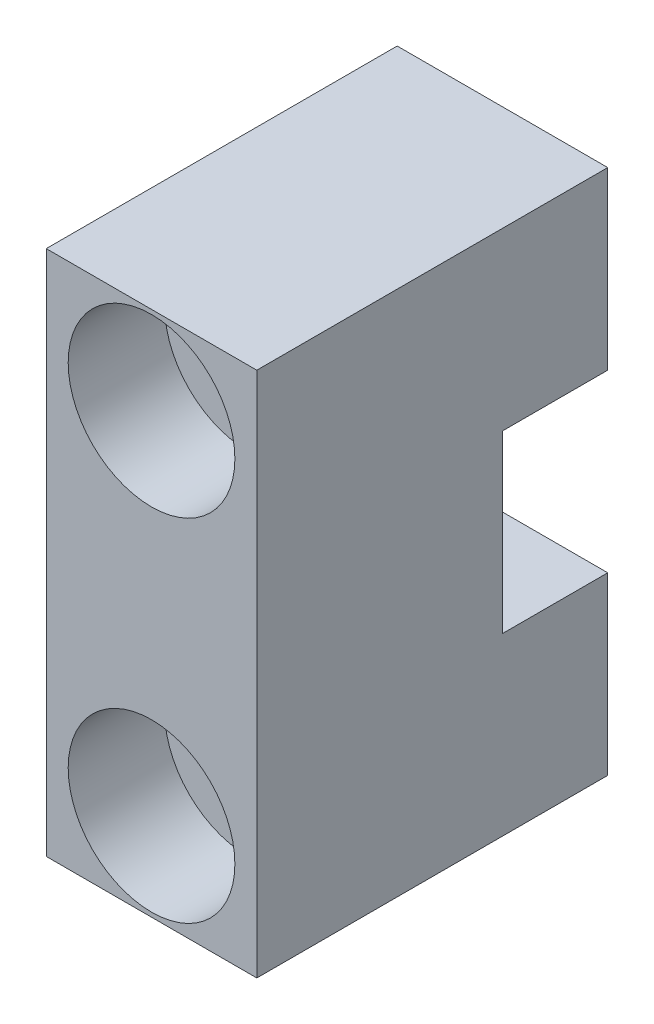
ISO-10303-21;
HEADER;
FILE_DESCRIPTION(('STEP AP214'),'2;1');
FILE_NAME('part.step','',(''),(''),'','','');
FILE_SCHEMA(('AUTOMOTIVE_DESIGN { 1 0 10303 214 1 1 1 1 }'));
ENDSEC;
DATA;
#1=APPLICATION_CONTEXT('core data for automotive mechanical design processes');
#2=APPLICATION_PROTOCOL_DEFINITION('international standard','automotive_design',2000,#1);
#3=PRODUCT_CONTEXT('',#1,'mechanical');
#4=PRODUCT('Part','Part','',(#3));
#5=PRODUCT_RELATED_PRODUCT_CATEGORY('part','',(#4));
#6=PRODUCT_DEFINITION_FORMATION('','',#4);
#7=PRODUCT_DEFINITION_CONTEXT('part definition',#1,'design');
#8=PRODUCT_DEFINITION('design','',#6,#7);
#9=PRODUCT_DEFINITION_SHAPE('','',#8);
#10=(LENGTH_UNIT() NAMED_UNIT(*) SI_UNIT(.MILLI.,.METRE.));
#11=(NAMED_UNIT(*) PLANE_ANGLE_UNIT() SI_UNIT($,.RADIAN.));
#12=(NAMED_UNIT(*) SI_UNIT($,.STERADIAN.) SOLID_ANGLE_UNIT());
#13=UNCERTAINTY_MEASURE_WITH_UNIT(LENGTH_MEASURE(1.E-05),#10,'distance_accuracy_value','');
#14=(GEOMETRIC_REPRESENTATION_CONTEXT(3) GLOBAL_UNCERTAINTY_ASSIGNED_CONTEXT((#13)) GLOBAL_UNIT_ASSIGNED_CONTEXT((#10,
#11,#12)) REPRESENTATION_CONTEXT('',''));
#15=CARTESIAN_POINT('',(0.,0.,0.));
#16=DIRECTION('',(0.,0.,1.));
#17=DIRECTION('',(1.,0.,0.));
#18=AXIS2_PLACEMENT_3D('',#15,#16,#17);
#19=CARTESIAN_POINT('',(6.,-5.,20.));
#20=DIRECTION('',(0.,0.,-1.));
#21=DIRECTION('',(-1.,0.,0.));
#22=AXIS2_PLACEMENT_3D('',#19,#20,#21);
#23=CYLINDRICAL_SURFACE('',#22,2.75);
#24=CARTESIAN_POINT('',(6.,-5.,0.));
#25=DIRECTION('',(0.,0.,1.));
#26=DIRECTION('',(1.,0.,0.));
#27=AXIS2_PLACEMENT_3D('',#24,#25,#26);
#28=CIRCLE('',#27,2.75);
#29=CARTESIAN_POINT('',(8.75,-5.,0.));
#30=VERTEX_POINT('',#29);
#31=EDGE_CURVE('E136',#30,#30,#28,.T.);
#32=ORIENTED_EDGE('',*,*,#31,.F.);
#33=EDGE_LOOP('',(#32));
#34=FACE_BOUND('',#33,.T.);
#35=CARTESIAN_POINT('',(6.,-5.,14.5));
#36=DIRECTION('',(0.,0.,1.));
#37=DIRECTION('',(1.,0.,0.));
#38=AXIS2_PLACEMENT_3D('',#35,#36,#37);
#39=CIRCLE('',#38,2.75);
#40=CARTESIAN_POINT('',(8.75,-5.,14.5));
#41=VERTEX_POINT('',#40);
#42=EDGE_CURVE('E36',#41,#41,#39,.T.);
#43=ORIENTED_EDGE('',*,*,#42,.T.);
#44=EDGE_LOOP('',(#43));
#45=FACE_BOUND('',#44,.T.);
#46=ADVANCED_FACE('F32',(#34,#45),#23,.F.);
#47=CARTESIAN_POINT('',(6.,-25.,20.));
#48=DIRECTION('',(0.,0.,-1.));
#49=DIRECTION('',(-1.,0.,0.));
#50=AXIS2_PLACEMENT_3D('',#47,#48,#49);
#51=CYLINDRICAL_SURFACE('',#50,2.75);
#52=CARTESIAN_POINT('',(6.,-25.,0.));
#53=DIRECTION('',(0.,0.,1.));
#54=DIRECTION('',(1.,0.,0.));
#55=AXIS2_PLACEMENT_3D('',#52,#53,#54);
#56=CIRCLE('',#55,2.75);
#57=CARTESIAN_POINT('',(8.75,-25.,0.));
#58=VERTEX_POINT('',#57);
#59=EDGE_CURVE('E139',#58,#58,#56,.T.);
#60=ORIENTED_EDGE('',*,*,#59,.F.);
#61=EDGE_LOOP('',(#60));
#62=FACE_BOUND('',#61,.T.);
#63=CARTESIAN_POINT('',(6.,-25.,14.5));
#64=DIRECTION('',(0.,0.,1.));
#65=DIRECTION('',(1.,0.,0.));
#66=AXIS2_PLACEMENT_3D('',#63,#64,#65);
#67=CIRCLE('',#66,2.75);
#68=CARTESIAN_POINT('',(8.75,-25.,14.5));
#69=VERTEX_POINT('',#68);
#70=EDGE_CURVE('E123',#69,#69,#67,.T.);
#71=ORIENTED_EDGE('',*,*,#70,.T.);
#72=EDGE_LOOP('',(#71));
#73=FACE_BOUND('',#72,.T.);
#74=ADVANCED_FACE('F204',(#62,#73),#51,.F.);
#75=CARTESIAN_POINT('',(12.,-30.,0.));
#76=DIRECTION('',(0.,0.,1.));
#77=DIRECTION('',(1.,0.,0.));
#78=AXIS2_PLACEMENT_3D('',#75,#76,#77);
#79=PLANE('',#78);
#80=ORIENTED_EDGE('',*,*,#59,.T.);
#81=EDGE_LOOP('',(#80));
#82=FACE_BOUND('',#81,.T.);
#83=DIRECTION('',(0.,-1.,0.));
#84=VECTOR('',#83,1.);
#85=CARTESIAN_POINT('',(0.,-30.,0.));
#86=LINE('',#85,#84);
#87=CARTESIAN_POINT('',(0.,-20.,0.));
#88=VERTEX_POINT('',#87);
#89=CARTESIAN_POINT('',(0.,-30.,0.));
#90=VERTEX_POINT('',#89);
#91=EDGE_CURVE('E78',#88,#90,#86,.T.);
#92=ORIENTED_EDGE('',*,*,#91,.F.);
#93=DIRECTION('',(1.,0.,0.));
#94=VECTOR('',#93,1.);
#95=CARTESIAN_POINT('',(12.,-20.,0.));
#96=LINE('',#95,#94);
#97=CARTESIAN_POINT('',(12.,-20.,0.));
#98=VERTEX_POINT('',#97);
#99=EDGE_CURVE('E133',#88,#98,#96,.T.);
#100=ORIENTED_EDGE('',*,*,#99,.T.);
#101=DIRECTION('',(0.,1.,0.));
#102=VECTOR('',#101,1.);
#103=CARTESIAN_POINT('',(12.,-30.,0.));
#104=LINE('',#103,#102);
#105=CARTESIAN_POINT('',(12.,-30.,0.));
#106=VERTEX_POINT('',#105);
#107=EDGE_CURVE('E154',#106,#98,#104,.T.);
#108=ORIENTED_EDGE('',*,*,#107,.F.);
#109=DIRECTION('',(1.,0.,0.));
#110=VECTOR('',#109,1.);
#111=CARTESIAN_POINT('',(0.,-30.,0.));
#112=LINE('',#111,#110);
#113=EDGE_CURVE('E142',#90,#106,#112,.T.);
#114=ORIENTED_EDGE('',*,*,#113,.F.);
#115=EDGE_LOOP('',(#92,#100,#108,#114));
#116=FACE_BOUND('',#115,.T.);
#117=ADVANCED_FACE('F210',(#82,#116),#79,.F.);
#118=CARTESIAN_POINT('',(12.,-30.,20.));
#119=DIRECTION('',(0.,0.,1.));
#120=DIRECTION('',(1.,0.,0.));
#121=AXIS2_PLACEMENT_3D('',#118,#119,#120);
#122=PLANE('',#121);
#123=CARTESIAN_POINT('',(6.,-5.,20.));
#124=DIRECTION('',(0.,0.,1.));
#125=DIRECTION('',(1.,0.,0.));
#126=AXIS2_PLACEMENT_3D('',#123,#124,#125);
#127=CIRCLE('',#126,4.75);
#128=CARTESIAN_POINT('',(10.75,-5.,20.));
#129=VERTEX_POINT('',#128);
#130=EDGE_CURVE('E182',#129,#129,#127,.T.);
#131=ORIENTED_EDGE('',*,*,#130,.F.);
#132=EDGE_LOOP('',(#131));
#133=FACE_BOUND('',#132,.T.);
#134=CARTESIAN_POINT('',(6.,-25.,20.));
#135=DIRECTION('',(0.,0.,1.));
#136=DIRECTION('',(1.,0.,0.));
#137=AXIS2_PLACEMENT_3D('',#134,#135,#136);
#138=CIRCLE('',#137,4.75);
#139=CARTESIAN_POINT('',(10.75,-25.,20.));
#140=VERTEX_POINT('',#139);
#141=EDGE_CURVE('E176',#140,#140,#138,.T.);
#142=ORIENTED_EDGE('',*,*,#141,.F.);
#143=EDGE_LOOP('',(#142));
#144=FACE_BOUND('',#143,.T.);
#145=DIRECTION('',(1.,0.,0.));
#146=VECTOR('',#145,1.);
#147=CARTESIAN_POINT('',(0.,-30.,20.));
#148=LINE('',#147,#146);
#149=CARTESIAN_POINT('',(0.,-30.,20.));
#150=VERTEX_POINT('',#149);
#151=CARTESIAN_POINT('',(12.,-30.,20.));
#152=VERTEX_POINT('',#151);
#153=EDGE_CURVE('E143',#150,#152,#148,.T.);
#154=ORIENTED_EDGE('',*,*,#153,.T.);
#155=DIRECTION('',(0.,1.,0.));
#156=VECTOR('',#155,1.);
#157=CARTESIAN_POINT('',(12.,-30.,20.));
#158=LINE('',#157,#156);
#159=CARTESIAN_POINT('',(12.,0.,20.));
#160=VERTEX_POINT('',#159);
#161=EDGE_CURVE('E86',#152,#160,#158,.T.);
#162=ORIENTED_EDGE('',*,*,#161,.T.);
#163=DIRECTION('',(-1.,0.,0.));
#164=VECTOR('',#163,1.);
#165=CARTESIAN_POINT('',(0.,0.,20.));
#166=LINE('',#165,#164);
#167=CARTESIAN_POINT('',(0.,0.,20.));
#168=VERTEX_POINT('',#167);
#169=EDGE_CURVE('E147',#160,#168,#166,.T.);
#170=ORIENTED_EDGE('',*,*,#169,.T.);
#171=DIRECTION('',(0.,-1.,0.));
#172=VECTOR('',#171,1.);
#173=CARTESIAN_POINT('',(0.,-30.,20.));
#174=LINE('',#173,#172);
#175=EDGE_CURVE('E58',#168,#150,#174,.T.);
#176=ORIENTED_EDGE('',*,*,#175,.T.);
#177=EDGE_LOOP('',(#154,#162,#170,#176));
#178=FACE_BOUND('',#177,.T.);
#179=ADVANCED_FACE('F217',(#133,#144,#178),#122,.T.);
#180=CARTESIAN_POINT('',(12.,-10.,0.));
#181=VERTEX_POINT('',#180);
#182=CARTESIAN_POINT('',(12.,0.,0.));
#183=VERTEX_POINT('',#182);
#184=EDGE_CURVE('E153',#181,#183,#104,.T.);
#185=ORIENTED_EDGE('',*,*,#184,.F.);
#186=DIRECTION('',(-1.,0.,0.));
#187=VECTOR('',#186,1.);
#188=CARTESIAN_POINT('',(12.,-10.,0.));
#189=LINE('',#188,#187);
#190=CARTESIAN_POINT('',(0.,-10.,0.));
#191=VERTEX_POINT('',#190);
#192=EDGE_CURVE('E121',#181,#191,#189,.T.);
#193=ORIENTED_EDGE('',*,*,#192,.T.);
#194=CARTESIAN_POINT('',(0.,0.,0.));
#195=VERTEX_POINT('',#194);
#196=EDGE_CURVE('E145',#195,#191,#86,.T.);
#197=ORIENTED_EDGE('',*,*,#196,.F.);
#198=DIRECTION('',(-1.,0.,0.));
#199=VECTOR('',#198,1.);
#200=CARTESIAN_POINT('',(0.,0.,0.));
#201=LINE('',#200,#199);
#202=EDGE_CURVE('E156',#183,#195,#201,.T.);
#203=ORIENTED_EDGE('',*,*,#202,.F.);
#204=EDGE_LOOP('',(#185,#193,#197,#203));
#205=FACE_BOUND('',#204,.T.);
#206=ORIENTED_EDGE('',*,*,#31,.T.);
#207=EDGE_LOOP('',(#206));
#208=FACE_BOUND('',#207,.T.);
#209=ADVANCED_FACE('F220',(#205,#208),#79,.F.);
#210=CARTESIAN_POINT('',(0.,-30.,20.));
#211=DIRECTION('',(0.,1.,0.));
#212=DIRECTION('',(0.,0.,1.));
#213=AXIS2_PLACEMENT_3D('',#210,#211,#212);
#214=PLANE('',#213);
#215=ORIENTED_EDGE('',*,*,#113,.T.);
#216=DIRECTION('',(0.,0.,-1.));
#217=VECTOR('',#216,1.);
#218=CARTESIAN_POINT('',(12.,-30.,20.));
#219=LINE('',#218,#217);
#220=EDGE_CURVE('E167',#152,#106,#219,.T.);
#221=ORIENTED_EDGE('',*,*,#220,.F.);
#222=ORIENTED_EDGE('',*,*,#153,.F.);
#223=DIRECTION('',(0.,0.,-1.));
#224=VECTOR('',#223,1.);
#225=CARTESIAN_POINT('',(0.,-30.,20.));
#226=LINE('',#225,#224);
#227=EDGE_CURVE('E150',#150,#90,#226,.T.);
#228=ORIENTED_EDGE('',*,*,#227,.T.);
#229=EDGE_LOOP('',(#215,#221,#222,#228));
#230=FACE_BOUND('',#229,.T.);
#231=ADVANCED_FACE('F34',(#230),#214,.F.);
#232=CARTESIAN_POINT('',(12.,-30.,20.));
#233=DIRECTION('',(-1.,0.,0.));
#234=DIRECTION('',(0.,0.,1.));
#235=AXIS2_PLACEMENT_3D('',#232,#233,#234);
#236=PLANE('',#235);
#237=ORIENTED_EDGE('',*,*,#107,.T.);
#238=DIRECTION('',(0.,0.,-1.));
#239=VECTOR('',#238,1.);
#240=CARTESIAN_POINT('',(12.,-20.,-4.6821981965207));
#241=LINE('',#240,#239);
#242=CARTESIAN_POINT('',(12.,-20.,6.));
#243=VERTEX_POINT('',#242);
#244=EDGE_CURVE('E115',#243,#98,#241,.T.);
#245=ORIENTED_EDGE('',*,*,#244,.F.);
#246=DIRECTION('',(0.,-1.,0.));
#247=VECTOR('',#246,1.);
#248=CARTESIAN_POINT('',(12.,-10.,6.));
#249=LINE('',#248,#247);
#250=CARTESIAN_POINT('',(12.,-10.,6.));
#251=VERTEX_POINT('',#250);
#252=EDGE_CURVE('E110',#251,#243,#249,.T.);
#253=ORIENTED_EDGE('',*,*,#252,.F.);
#254=DIRECTION('',(0.,0.,1.));
#255=VECTOR('',#254,1.);
#256=CARTESIAN_POINT('',(12.,-10.,-4.6821981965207));
#257=LINE('',#256,#255);
#258=EDGE_CURVE('E118',#181,#251,#257,.T.);
#259=ORIENTED_EDGE('',*,*,#258,.F.);
#260=ORIENTED_EDGE('',*,*,#184,.T.);
#261=DIRECTION('',(0.,0.,-1.));
#262=VECTOR('',#261,1.);
#263=CARTESIAN_POINT('',(12.,0.,20.));
#264=LINE('',#263,#262);
#265=EDGE_CURVE('E164',#160,#183,#264,.T.);
#266=ORIENTED_EDGE('',*,*,#265,.F.);
#267=ORIENTED_EDGE('',*,*,#161,.F.);
#268=ORIENTED_EDGE('',*,*,#220,.T.);
#269=EDGE_LOOP('',(#237,#245,#253,#259,#260,#266,#267,#268));
#270=FACE_BOUND('',#269,.T.);
#271=ADVANCED_FACE('F126',(#270),#236,.F.);
#272=CARTESIAN_POINT('',(0.,0.,20.));
#273=DIRECTION('',(0.,-1.,0.));
#274=DIRECTION('',(0.,0.,-1.));
#275=AXIS2_PLACEMENT_3D('',#272,#273,#274);
#276=PLANE('',#275);
#277=ORIENTED_EDGE('',*,*,#202,.T.);
#278=DIRECTION('',(0.,0.,-1.));
#279=VECTOR('',#278,1.);
#280=CARTESIAN_POINT('',(0.,0.,20.));
#281=LINE('',#280,#279);
#282=EDGE_CURVE('E161',#168,#195,#281,.T.);
#283=ORIENTED_EDGE('',*,*,#282,.F.);
#284=ORIENTED_EDGE('',*,*,#169,.F.);
#285=ORIENTED_EDGE('',*,*,#265,.T.);
#286=EDGE_LOOP('',(#277,#283,#284,#285));
#287=FACE_BOUND('',#286,.T.);
#288=ADVANCED_FACE('F229',(#287),#276,.F.);
#289=CARTESIAN_POINT('',(0.,-30.,20.));
#290=DIRECTION('',(1.,0.,0.));
#291=DIRECTION('',(0.,0.,-1.));
#292=AXIS2_PLACEMENT_3D('',#289,#290,#291);
#293=PLANE('',#292);
#294=DIRECTION('',(0.,-1.,0.));
#295=VECTOR('',#294,1.);
#296=CARTESIAN_POINT('',(0.,-30.,6.));
#297=LINE('',#296,#295);
#298=CARTESIAN_POINT('',(0.,-10.,6.));
#299=VERTEX_POINT('',#298);
#300=CARTESIAN_POINT('',(0.,-20.,6.));
#301=VERTEX_POINT('',#300);
#302=EDGE_CURVE('E41',#299,#301,#297,.T.);
#303=ORIENTED_EDGE('',*,*,#302,.T.);
#304=DIRECTION('',(0.,0.,-1.));
#305=VECTOR('',#304,1.);
#306=CARTESIAN_POINT('',(0.,-20.,20.));
#307=LINE('',#306,#305);
#308=EDGE_CURVE('E11',#301,#88,#307,.T.);
#309=ORIENTED_EDGE('',*,*,#308,.T.);
#310=ORIENTED_EDGE('',*,*,#91,.T.);
#311=ORIENTED_EDGE('',*,*,#227,.F.);
#312=ORIENTED_EDGE('',*,*,#175,.F.);
#313=ORIENTED_EDGE('',*,*,#282,.T.);
#314=ORIENTED_EDGE('',*,*,#196,.T.);
#315=DIRECTION('',(0.,0.,1.));
#316=VECTOR('',#315,1.);
#317=CARTESIAN_POINT('',(0.,-10.,20.));
#318=LINE('',#317,#316);
#319=EDGE_CURVE('E169',#191,#299,#318,.T.);
#320=ORIENTED_EDGE('',*,*,#319,.T.);
#321=EDGE_LOOP('',(#303,#309,#310,#311,#312,#313,#314,#320));
#322=FACE_BOUND('',#321,.T.);
#323=ADVANCED_FACE('F225',(#322),#293,.F.);
#324=CARTESIAN_POINT('',(-8.,-20.,-4.6821981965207));
#325=DIRECTION('',(0.,-1.,0.));
#326=DIRECTION('',(0.,0.,-1.));
#327=AXIS2_PLACEMENT_3D('',#324,#325,#326);
#328=PLANE('',#327);
#329=ORIENTED_EDGE('',*,*,#308,.F.);
#330=DIRECTION('',(1.,0.,0.));
#331=VECTOR('',#330,1.);
#332=CARTESIAN_POINT('',(-8.,-20.,6.));
#333=LINE('',#332,#331);
#334=EDGE_CURVE('E114',#301,#243,#333,.T.);
#335=ORIENTED_EDGE('',*,*,#334,.T.);
#336=ORIENTED_EDGE('',*,*,#244,.T.);
#337=ORIENTED_EDGE('',*,*,#99,.F.);
#338=EDGE_LOOP('',(#329,#335,#336,#337));
#339=FACE_BOUND('',#338,.T.);
#340=ADVANCED_FACE('F228',(#339),#328,.F.);
#341=CARTESIAN_POINT('',(-8.,-10.,6.));
#342=DIRECTION('',(0.,0.,1.));
#343=DIRECTION('',(1.,0.,0.));
#344=AXIS2_PLACEMENT_3D('',#341,#342,#343);
#345=PLANE('',#344);
#346=DIRECTION('',(1.,0.,0.));
#347=VECTOR('',#346,1.);
#348=CARTESIAN_POINT('',(-8.,-10.,6.));
#349=LINE('',#348,#347);
#350=EDGE_CURVE('E49',#299,#251,#349,.T.);
#351=ORIENTED_EDGE('',*,*,#350,.T.);
#352=ORIENTED_EDGE('',*,*,#252,.T.);
#353=ORIENTED_EDGE('',*,*,#334,.F.);
#354=ORIENTED_EDGE('',*,*,#302,.F.);
#355=EDGE_LOOP('',(#351,#352,#353,#354));
#356=FACE_BOUND('',#355,.T.);
#357=ADVANCED_FACE('F107',(#356),#345,.F.);
#358=CARTESIAN_POINT('',(-8.,-10.,-4.6821981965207));
#359=DIRECTION('',(0.,1.,0.));
#360=DIRECTION('',(0.,0.,1.));
#361=AXIS2_PLACEMENT_3D('',#358,#359,#360);
#362=PLANE('',#361);
#363=ORIENTED_EDGE('',*,*,#258,.T.);
#364=ORIENTED_EDGE('',*,*,#350,.F.);
#365=ORIENTED_EDGE('',*,*,#319,.F.);
#366=ORIENTED_EDGE('',*,*,#192,.F.);
#367=EDGE_LOOP('',(#363,#364,#365,#366));
#368=FACE_BOUND('',#367,.T.);
#369=ADVANCED_FACE('F119',(#368),#362,.F.);
#370=CARTESIAN_POINT('',(6.,-25.,14.5));
#371=DIRECTION('',(0.,0.,1.));
#372=DIRECTION('',(1.,0.,0.));
#373=AXIS2_PLACEMENT_3D('',#370,#371,#372);
#374=CYLINDRICAL_SURFACE('',#373,4.75);
#375=CARTESIAN_POINT('',(6.,-25.,14.5));
#376=DIRECTION('',(0.,0.,1.));
#377=DIRECTION('',(1.,0.,0.));
#378=AXIS2_PLACEMENT_3D('',#375,#376,#377);
#379=CIRCLE('',#378,4.75);
#380=CARTESIAN_POINT('',(10.75,-25.,14.5));
#381=VERTEX_POINT('',#380);
#382=EDGE_CURVE('E172',#381,#381,#379,.T.);
#383=ORIENTED_EDGE('',*,*,#382,.F.);
#384=EDGE_LOOP('',(#383));
#385=FACE_BOUND('',#384,.T.);
#386=ORIENTED_EDGE('',*,*,#141,.T.);
#387=EDGE_LOOP('',(#386));
#388=FACE_BOUND('',#387,.T.);
#389=ADVANCED_FACE('F255',(#385,#388),#374,.F.);
#390=CARTESIAN_POINT('',(6.,-25.,14.5));
#391=DIRECTION('',(0.,0.,1.));
#392=DIRECTION('',(1.,0.,0.));
#393=AXIS2_PLACEMENT_3D('',#390,#391,#392);
#394=PLANE('',#393);
#395=ORIENTED_EDGE('',*,*,#70,.F.);
#396=EDGE_LOOP('',(#395));
#397=FACE_BOUND('',#396,.T.);
#398=ORIENTED_EDGE('',*,*,#382,.T.);
#399=EDGE_LOOP('',(#398));
#400=FACE_BOUND('',#399,.T.);
#401=ADVANCED_FACE('F200',(#397,#400),#394,.T.);
#402=CARTESIAN_POINT('',(6.,-5.,14.5));
#403=DIRECTION('',(0.,0.,1.));
#404=DIRECTION('',(1.,0.,0.));
#405=AXIS2_PLACEMENT_3D('',#402,#403,#404);
#406=CYLINDRICAL_SURFACE('',#405,4.75);
#407=CARTESIAN_POINT('',(6.,-5.,14.5));
#408=DIRECTION('',(0.,0.,1.));
#409=DIRECTION('',(1.,0.,0.));
#410=AXIS2_PLACEMENT_3D('',#407,#408,#409);
#411=CIRCLE('',#410,4.75);
#412=CARTESIAN_POINT('',(10.75,-5.,14.5));
#413=VERTEX_POINT('',#412);
#414=EDGE_CURVE('E185',#413,#413,#411,.T.);
#415=ORIENTED_EDGE('',*,*,#414,.F.);
#416=EDGE_LOOP('',(#415));
#417=FACE_BOUND('',#416,.T.);
#418=ORIENTED_EDGE('',*,*,#130,.T.);
#419=EDGE_LOOP('',(#418));
#420=FACE_BOUND('',#419,.T.);
#421=ADVANCED_FACE('F195',(#417,#420),#406,.F.);
#422=CARTESIAN_POINT('',(6.,-5.,14.5));
#423=DIRECTION('',(0.,0.,1.));
#424=DIRECTION('',(1.,0.,0.));
#425=AXIS2_PLACEMENT_3D('',#422,#423,#424);
#426=PLANE('',#425);
#427=ORIENTED_EDGE('',*,*,#42,.F.);
#428=EDGE_LOOP('',(#427));
#429=FACE_BOUND('',#428,.T.);
#430=ORIENTED_EDGE('',*,*,#414,.T.);
#431=EDGE_LOOP('',(#430));
#432=FACE_BOUND('',#431,.T.);
#433=ADVANCED_FACE('F193',(#429,#432),#426,.T.);
#434=CLOSED_SHELL('',(#46,#74,#117,#179,#209,#231,#271,#288,#323,#340,#357,#369,#389,#401,#421,#433));
#435=MANIFOLD_SOLID_BREP('B2',#434);
#436=ADVANCED_BREP_SHAPE_REPRESENTATION('',(#18,#435),#14);
#437=SHAPE_DEFINITION_REPRESENTATION(#9,#436);
ENDSEC;
END-ISO-10303-21;
